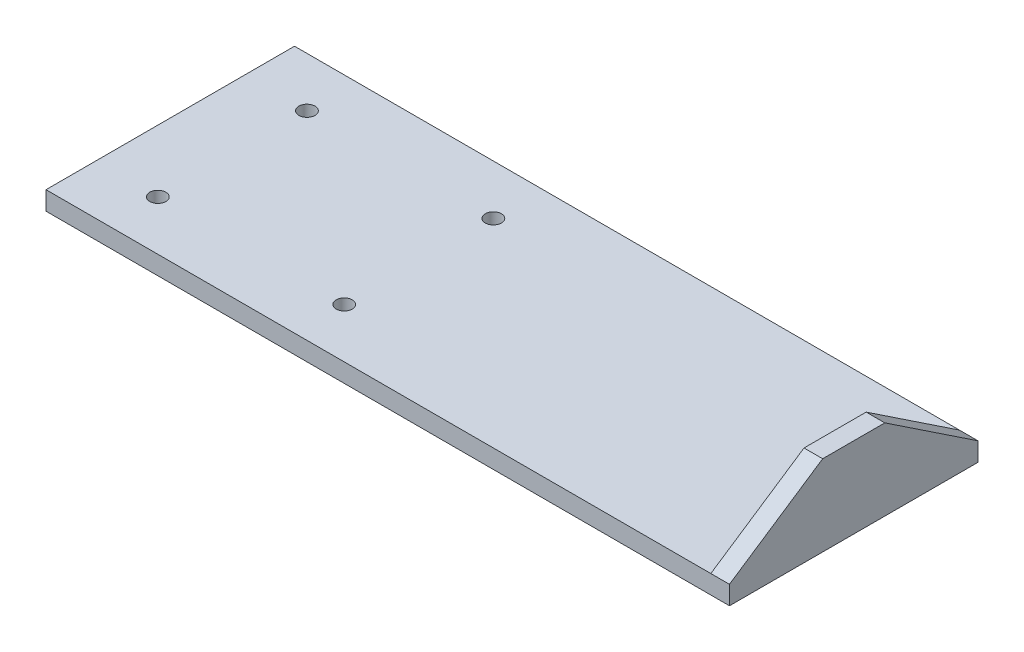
from build123d import *

# Parameters (mm, degrees)
SKETCH1_W               = 550
SKETCH1_H               = 200
EXTRUDE1_DEPTH          = 15
SKETCH3_W               = 15
SKETCH3_H               = 200
EXTRUDE2_DEPTH          = 50
CUT_EXTRUDE3_DEPTH      = 547.557407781
CUT_EXTRUDE3_DEPTH_BACK = 547.557407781
CUT_EXTRUDE4_DEPTH      = 547.557407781
CUT_EXTRUDE4_DEPTH_BACK = 547.557407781
SKETCH8_R               = 6.5
CUT_EXTRUDE5_DEPTH      = 562.248608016


with BuildPart() as part:
    # Sketch1 → Extrude1 (new body)
    with BuildSketch(Plane(origin=(0, 0, 0), x_dir=(1, 0, 0), z_dir=(0, 1, 0))):
        with Locations((275, 0)):
            Rectangle(SKETCH1_W, SKETCH1_H)
    extrude(amount=-EXTRUDE1_DEPTH)

    # Sketch3 → Extrude2 (add)
    with BuildSketch(Plane(origin=(0, 0, 0), x_dir=(-1, 0, 0), z_dir=(0, 1, 0))):
        with Locations((-542.5, 0)):
            Rectangle(SKETCH3_W, SKETCH3_H)
    extrude(amount=EXTRUDE2_DEPTH)

    # Sketch4 → Cut-Extrude3 (cut, two sides: drawn at the far end of the back side and taken through both)
    with BuildSketch(Plane.ZY.offset(-535).offset(-CUT_EXTRUDE3_DEPTH_BACK)):
        Polygon((-100, 50), (-100, 0), (-25, 50), align=None)
    extrude(amount=CUT_EXTRUDE3_DEPTH + CUT_EXTRUDE3_DEPTH_BACK, mode=Mode.SUBTRACT)

    # Sketch7 → Cut-Extrude4 (cut, two sides: drawn at the far end of the back side and taken through both)
    with BuildSketch(Plane.ZY.offset(-535).offset(-CUT_EXTRUDE4_DEPTH_BACK)):
        Polygon((451.383627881, -234.255751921), (100, 0), (25, 50), (-326.383627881, 284.255751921), (142.12787596, 987.023007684), (919.895131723, 468.511503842), align=None)
    extrude(amount=CUT_EXTRUDE4_DEPTH + CUT_EXTRUDE4_DEPTH_BACK, mode=Mode.SUBTRACT)

    # Sketch8 → Cut-Extrude5 (cut, through all)
    with BuildSketch(Plane(origin=(0, 0, 0), x_dir=(-1, 0, 0), z_dir=(0, 1, 0))):
        with Locations(Location((-50, -60, 0), (0, 0, 90))):
            Circle(SKETCH8_R)
        with Locations(Location((-200, -60, 0), (0, 0, 90))):
            Circle(SKETCH8_R)
        with Locations(Location((-50, 60, 0), (0, 0, 90))):
            Circle(SKETCH8_R)
        with Locations(Location((-200, 60, 0), (0, 0, 90))):
            Circle(SKETCH8_R)
    extrude(amount=-CUT_EXTRUDE5_DEPTH, mode=Mode.SUBTRACT)


solid = part.part
